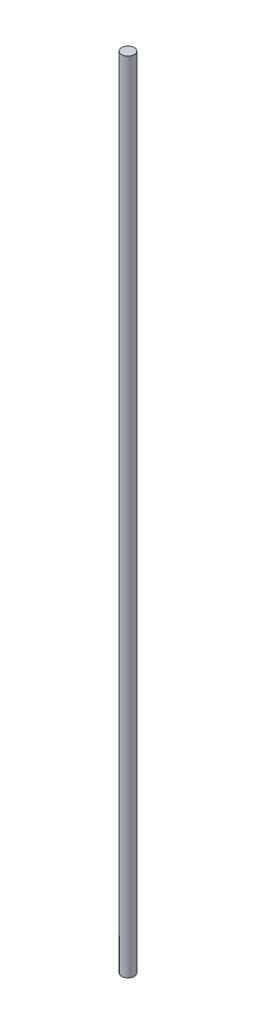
from build123d import *

# Parameters (mm, degrees)
SKETCH1_R           = 4.7625
BOSS_EXTRUDE1_DEPTH = 609.6


with BuildPart() as part:
    # Sketch1 → Boss-Extrude1 (new body)
    with BuildSketch(Plane(origin=(0, 0, 0), x_dir=(1, 0, 0), z_dir=(0, 1, 0))):
        with Locations(Location((0, 0, 0), (0, 0, 90))):
            Circle(SKETCH1_R)
    extrude(amount=BOSS_EXTRUDE1_DEPTH)


solid = part.part
